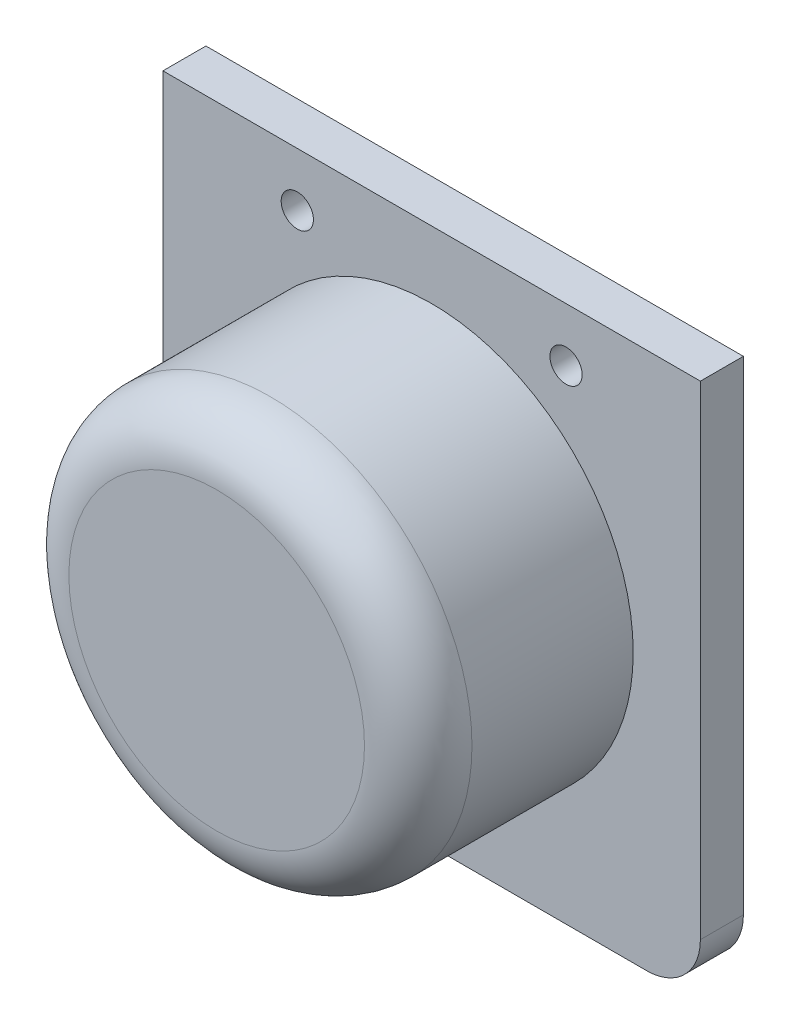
from build123d import *

# Parameters (mm, degrees)
SKETCH1_W           = 100
SKETCH1_H           = 100
BOSS_EXTRUDE1_DEPTH = 8
SKETCH3_R           = 37.5
BOSS_EXTRUDE2_DEPTH = 40
CUT_EXTRUDE1_REACH  = 87.463
SKETCH4_R           = 3
FILLET1_R           = 10
SKETCH5_R           = 1.5
CUT_EXTRUDE2_DEPTH  = 2


with BuildPart() as part:
    # Sketch1 → Boss-Extrude1 (new body)
    with BuildSketch(Plane.XY):
        Rectangle(SKETCH1_W, SKETCH1_H)
    extrude(amount=BOSS_EXTRUDE1_DEPTH)

    # Sketch3 → Boss-Extrude2 (add)
    with BuildSketch(Plane.XY.offset(8)):
        Circle(SKETCH3_R)
    extrude(amount=BOSS_EXTRUDE2_DEPTH)

    # Sketch4 → Cut-Extrude1 (cut, up to next)
    with BuildSketch(Plane(origin=(0, 0, 0), x_dir=(-1, 0, 0), z_dir=(0, 0, -1)), mode=Mode.PRIVATE) as cut_extrude1_sk1:
        with Locations((-25, 40)):
            Circle(SKETCH4_R)
    cut_extrude1_tool1 = extrude(cut_extrude1_sk1.sketch, amount=-CUT_EXTRUDE1_REACH, mode=Mode.PRIVATE) & part.part
    # Sketch4 → Cut-Extrude1 (cut, up to next)
    with BuildSketch(Plane(origin=(0, 0, 0), x_dir=(-1, 0, 0), z_dir=(0, 0, -1)), mode=Mode.PRIVATE) as cut_extrude1_sk2:
        with Locations((25, 40)):
            Circle(SKETCH4_R)
    cut_extrude1_tool2 = extrude(cut_extrude1_sk2.sketch, amount=-CUT_EXTRUDE1_REACH, mode=Mode.PRIVATE) & part.part
    add(cut_extrude1_tool1.solids().sort_by_distance((25, 40, 0))[0], mode=Mode.SUBTRACT)
    add(cut_extrude1_tool2.solids().sort_by_distance((-25, 40, 0))[0], mode=Mode.SUBTRACT)

    # Fillet1
    fillet1_edges = [part.edges().sort_by_distance(p)[0] for p in [
        (-37.5, 0, 48),
        (50, -50, 4),
        (-50, -50, 4),
    ]]
    fillet(fillet1_edges, radius=FILLET1_R)

    # Sketch5 → Cut-Extrude2 (cut)
    with BuildSketch(Plane.XY.offset(8)):
        with Locations((-40, -40)):
            Circle(SKETCH5_R)
        with Locations((-30, -40)):
            Circle(SKETCH5_R)
    extrude(amount=-CUT_EXTRUDE2_DEPTH, mode=Mode.SUBTRACT)


solid = part.part
